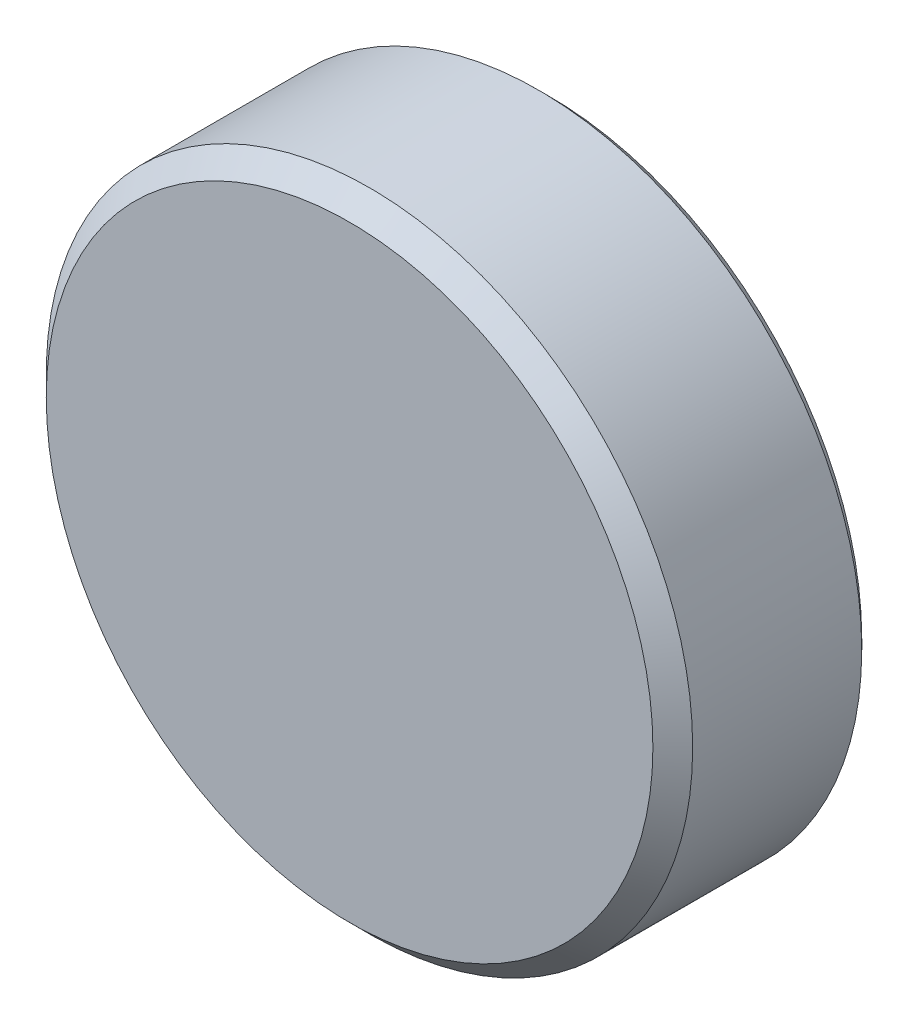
from build123d import *

# Parameters (mm, degrees)
SKETCH1_R      = 41.275
EXTRUDE1_DEPTH = 25.4
CHAMFER1_SIZE  = 2.54
CHAMFER2_SIZE  = 1.27


with BuildPart() as part:
    # Sketch1 → Extrude1 (new body)
    with BuildSketch(Plane.XY):
        Circle(SKETCH1_R)
    extrude(amount=EXTRUDE1_DEPTH)

    # Chamfer1
    chamfer1_edges = [part.edges().sort_by_distance(p)[0] for p in [
        (-41.275, 0, 25.4),
    ]]
    chamfer(chamfer1_edges, length=CHAMFER1_SIZE)

    # Chamfer2
    chamfer2_edges = [part.edges().sort_by_distance(p)[0] for p in [
        (-41.275, 0, 0),
    ]]
    chamfer(chamfer2_edges, length=CHAMFER2_SIZE)


solid = part.part
